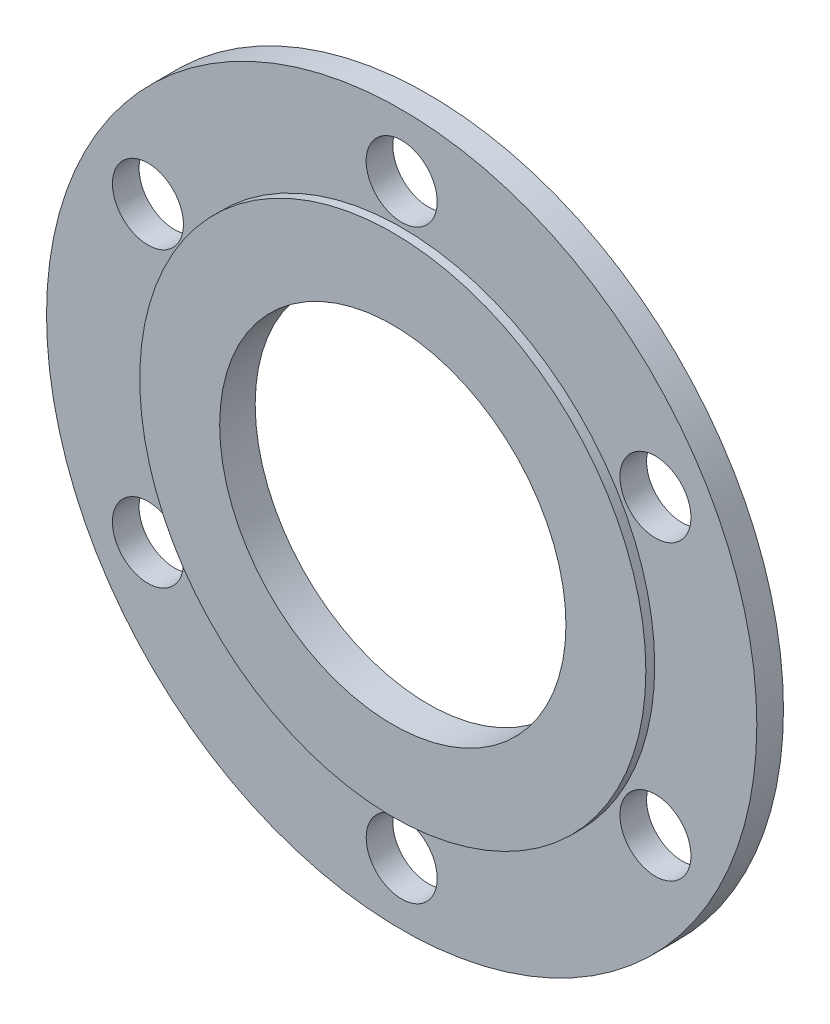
ISO-10303-21;
HEADER;
FILE_DESCRIPTION(('STEP AP214'),'2;1');
FILE_NAME('part.step','',(''),(''),'','','');
FILE_SCHEMA(('AUTOMOTIVE_DESIGN { 1 0 10303 214 1 1 1 1 }'));
ENDSEC;
DATA;
#1=APPLICATION_CONTEXT('core data for automotive mechanical design processes');
#2=APPLICATION_PROTOCOL_DEFINITION('international standard','automotive_design',2000,#1);
#3=PRODUCT_CONTEXT('',#1,'mechanical');
#4=PRODUCT('Part','Part','',(#3));
#5=PRODUCT_RELATED_PRODUCT_CATEGORY('part','',(#4));
#6=PRODUCT_DEFINITION_FORMATION('','',#4);
#7=PRODUCT_DEFINITION_CONTEXT('part definition',#1,'design');
#8=PRODUCT_DEFINITION('design','',#6,#7);
#9=PRODUCT_DEFINITION_SHAPE('','',#8);
#10=(LENGTH_UNIT() NAMED_UNIT(*) SI_UNIT(.MILLI.,.METRE.));
#11=(NAMED_UNIT(*) PLANE_ANGLE_UNIT() SI_UNIT($,.RADIAN.));
#12=(NAMED_UNIT(*) SI_UNIT($,.STERADIAN.) SOLID_ANGLE_UNIT());
#13=UNCERTAINTY_MEASURE_WITH_UNIT(LENGTH_MEASURE(1.E-05),#10,'distance_accuracy_value','');
#14=(GEOMETRIC_REPRESENTATION_CONTEXT(3) GLOBAL_UNCERTAINTY_ASSIGNED_CONTEXT((#13)) GLOBAL_UNIT_ASSIGNED_CONTEXT((#10,
#11,#12)) REPRESENTATION_CONTEXT('',''));
#15=CARTESIAN_POINT('',(0.,0.,0.));
#16=DIRECTION('',(0.,0.,1.));
#17=DIRECTION('',(1.,0.,0.));
#18=AXIS2_PLACEMENT_3D('',#15,#16,#17);
#19=CARTESIAN_POINT('',(0.,0.,3.));
#20=DIRECTION('',(0.,0.,1.));
#21=DIRECTION('',(1.,0.,0.));
#22=AXIS2_PLACEMENT_3D('',#19,#20,#21);
#23=PLANE('',#22);
#24=CARTESIAN_POINT('',(-28.5788383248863,16.5000000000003,3.));
#25=DIRECTION('',(0.,0.,1.));
#26=DIRECTION('',(0.50000000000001,0.866025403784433,0.));
#27=AXIS2_PLACEMENT_3D('',#24,#25,#26);
#28=CIRCLE('',#27,4.);
#29=CARTESIAN_POINT('',(-26.5788383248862,19.9641016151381,3.));
#30=VERTEX_POINT('',#29);
#31=EDGE_CURVE('E88',#30,#30,#28,.T.);
#32=ORIENTED_EDGE('',*,*,#31,.F.);
#33=EDGE_LOOP('',(#32));
#34=FACE_BOUND('',#33,.T.);
#35=CARTESIAN_POINT('',(-28.5788383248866,-16.4999999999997,3.));
#36=DIRECTION('',(0.,0.,1.));
#37=DIRECTION('',(-0.499999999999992,0.866025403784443,0.));
#38=AXIS2_PLACEMENT_3D('',#35,#36,#37);
#39=CIRCLE('',#38,4.);
#40=CARTESIAN_POINT('',(-30.5788383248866,-13.035898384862,3.));
#41=VERTEX_POINT('',#40);
#42=EDGE_CURVE('E82',#41,#41,#39,.T.);
#43=ORIENTED_EDGE('',*,*,#42,.F.);
#44=EDGE_LOOP('',(#43));
#45=FACE_BOUND('',#44,.T.);
#46=CARTESIAN_POINT('',(-2.31888233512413E-13,-33.,3.));
#47=DIRECTION('',(0.,0.,1.));
#48=DIRECTION('',(-1.,0.,0.));
#49=AXIS2_PLACEMENT_3D('',#46,#47,#48);
#50=CIRCLE('',#49,4.);
#51=CARTESIAN_POINT('',(-4.00000000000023,-33.,3.));
#52=VERTEX_POINT('',#51);
#53=EDGE_CURVE('E76',#52,#52,#50,.T.);
#54=ORIENTED_EDGE('',*,*,#53,.F.);
#55=EDGE_LOOP('',(#54));
#56=FACE_BOUND('',#55,.T.);
#57=CARTESIAN_POINT('',(28.5788383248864,-16.5000000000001,3.));
#58=DIRECTION('',(0.,0.,1.));
#59=DIRECTION('',(-0.500000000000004,-0.866025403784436,0.));
#60=AXIS2_PLACEMENT_3D('',#57,#58,#59);
#61=CIRCLE('',#60,4.);
#62=CARTESIAN_POINT('',(26.5788383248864,-19.9641016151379,3.));
#63=VERTEX_POINT('',#62);
#64=EDGE_CURVE('E70',#63,#63,#61,.T.);
#65=ORIENTED_EDGE('',*,*,#64,.F.);
#66=EDGE_LOOP('',(#65));
#67=FACE_BOUND('',#66,.T.);
#68=CARTESIAN_POINT('',(28.5788383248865,16.4999999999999,3.));
#69=DIRECTION('',(0.,0.,1.));
#70=DIRECTION('',(0.499999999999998,-0.86602540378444,0.));
#71=AXIS2_PLACEMENT_3D('',#68,#69,#70);
#72=CIRCLE('',#71,4.);
#73=CARTESIAN_POINT('',(30.5788383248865,13.0358983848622,3.));
#74=VERTEX_POINT('',#73);
#75=EDGE_CURVE('E64',#74,#74,#72,.T.);
#76=ORIENTED_EDGE('',*,*,#75,.F.);
#77=EDGE_LOOP('',(#76));
#78=FACE_BOUND('',#77,.T.);
#79=CARTESIAN_POINT('',(0.,33.,3.));
#80=DIRECTION('',(0.,0.,1.));
#81=DIRECTION('',(1.,0.,0.));
#82=AXIS2_PLACEMENT_3D('',#79,#80,#81);
#83=CIRCLE('',#82,4.);
#84=CARTESIAN_POINT('',(4.,33.,3.));
#85=VERTEX_POINT('',#84);
#86=EDGE_CURVE('E58',#85,#85,#83,.T.);
#87=ORIENTED_EDGE('',*,*,#86,.F.);
#88=EDGE_LOOP('',(#87));
#89=FACE_BOUND('',#88,.T.);
#90=CARTESIAN_POINT('',(0.,0.,3.));
#91=DIRECTION('',(0.,0.,1.));
#92=DIRECTION('',(1.,0.,0.));
#93=AXIS2_PLACEMENT_3D('',#90,#91,#92);
#94=CIRCLE('',#93,40.);
#95=CARTESIAN_POINT('',(40.,0.,3.));
#96=VERTEX_POINT('',#95);
#97=EDGE_CURVE('E10',#96,#96,#94,.T.);
#98=ORIENTED_EDGE('',*,*,#97,.T.);
#99=EDGE_LOOP('',(#98));
#100=FACE_BOUND('',#99,.T.);
#101=CARTESIAN_POINT('',(0.,0.,3.));
#102=DIRECTION('',(0.,0.,1.));
#103=DIRECTION('',(1.,0.,0.));
#104=AXIS2_PLACEMENT_3D('',#101,#102,#103);
#105=CIRCLE('',#104,28.5);
#106=CARTESIAN_POINT('',(28.5,0.,3.));
#107=VERTEX_POINT('',#106);
#108=EDGE_CURVE('E44',#107,#107,#105,.T.);
#109=ORIENTED_EDGE('',*,*,#108,.F.);
#110=EDGE_LOOP('',(#109));
#111=FACE_BOUND('',#110,.T.);
#112=ADVANCED_FACE('F29',(#34,#45,#56,#67,#78,#89,#100,#111),#23,.T.);
#113=CARTESIAN_POINT('',(0.,0.,3.));
#114=DIRECTION('',(0.,0.,-1.));
#115=DIRECTION('',(-1.,0.,0.));
#116=AXIS2_PLACEMENT_3D('',#113,#114,#115);
#117=CYLINDRICAL_SURFACE('',#116,40.);
#118=ORIENTED_EDGE('',*,*,#97,.F.);
#119=EDGE_LOOP('',(#118));
#120=FACE_BOUND('',#119,.T.);
#121=CARTESIAN_POINT('',(0.,0.,0.));
#122=DIRECTION('',(0.,0.,1.));
#123=DIRECTION('',(1.,0.,0.));
#124=AXIS2_PLACEMENT_3D('',#121,#122,#123);
#125=CIRCLE('',#124,40.);
#126=CARTESIAN_POINT('',(40.,0.,0.));
#127=VERTEX_POINT('',#126);
#128=EDGE_CURVE('E36',#127,#127,#125,.T.);
#129=ORIENTED_EDGE('',*,*,#128,.T.);
#130=EDGE_LOOP('',(#129));
#131=FACE_BOUND('',#130,.T.);
#132=ADVANCED_FACE('F31',(#120,#131),#117,.T.);
#133=CARTESIAN_POINT('',(0.,0.,0.));
#134=DIRECTION('',(0.,0.,1.));
#135=DIRECTION('',(1.,0.,0.));
#136=AXIS2_PLACEMENT_3D('',#133,#134,#135);
#137=PLANE('',#136);
#138=CARTESIAN_POINT('',(-28.5788383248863,16.5000000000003,0.));
#139=DIRECTION('',(0.,0.,1.));
#140=DIRECTION('',(0.50000000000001,0.866025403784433,0.));
#141=AXIS2_PLACEMENT_3D('',#138,#139,#140);
#142=CIRCLE('',#141,4.);
#143=CARTESIAN_POINT('',(-26.5788383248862,19.9641016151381,0.));
#144=VERTEX_POINT('',#143);
#145=EDGE_CURVE('E85',#144,#144,#142,.T.);
#146=ORIENTED_EDGE('',*,*,#145,.T.);
#147=EDGE_LOOP('',(#146));
#148=FACE_BOUND('',#147,.T.);
#149=CARTESIAN_POINT('',(-28.5788383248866,-16.4999999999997,0.));
#150=DIRECTION('',(0.,0.,1.));
#151=DIRECTION('',(-0.499999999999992,0.866025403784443,0.));
#152=AXIS2_PLACEMENT_3D('',#149,#150,#151);
#153=CIRCLE('',#152,4.);
#154=CARTESIAN_POINT('',(-30.5788383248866,-13.035898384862,0.));
#155=VERTEX_POINT('',#154);
#156=EDGE_CURVE('E79',#155,#155,#153,.T.);
#157=ORIENTED_EDGE('',*,*,#156,.T.);
#158=EDGE_LOOP('',(#157));
#159=FACE_BOUND('',#158,.T.);
#160=CARTESIAN_POINT('',(-2.31888233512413E-13,-33.,0.));
#161=DIRECTION('',(0.,0.,1.));
#162=DIRECTION('',(-1.,0.,0.));
#163=AXIS2_PLACEMENT_3D('',#160,#161,#162);
#164=CIRCLE('',#163,4.);
#165=CARTESIAN_POINT('',(-4.00000000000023,-33.,0.));
#166=VERTEX_POINT('',#165);
#167=EDGE_CURVE('E73',#166,#166,#164,.T.);
#168=ORIENTED_EDGE('',*,*,#167,.T.);
#169=EDGE_LOOP('',(#168));
#170=FACE_BOUND('',#169,.T.);
#171=CARTESIAN_POINT('',(28.5788383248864,-16.5000000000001,0.));
#172=DIRECTION('',(0.,0.,1.));
#173=DIRECTION('',(-0.500000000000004,-0.866025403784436,0.));
#174=AXIS2_PLACEMENT_3D('',#171,#172,#173);
#175=CIRCLE('',#174,4.);
#176=CARTESIAN_POINT('',(26.5788383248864,-19.9641016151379,0.));
#177=VERTEX_POINT('',#176);
#178=EDGE_CURVE('E67',#177,#177,#175,.T.);
#179=ORIENTED_EDGE('',*,*,#178,.T.);
#180=EDGE_LOOP('',(#179));
#181=FACE_BOUND('',#180,.T.);
#182=CARTESIAN_POINT('',(28.5788383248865,16.4999999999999,0.));
#183=DIRECTION('',(0.,0.,1.));
#184=DIRECTION('',(0.499999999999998,-0.86602540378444,0.));
#185=AXIS2_PLACEMENT_3D('',#182,#183,#184);
#186=CIRCLE('',#185,4.);
#187=CARTESIAN_POINT('',(30.5788383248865,13.0358983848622,0.));
#188=VERTEX_POINT('',#187);
#189=EDGE_CURVE('E61',#188,#188,#186,.T.);
#190=ORIENTED_EDGE('',*,*,#189,.T.);
#191=EDGE_LOOP('',(#190));
#192=FACE_BOUND('',#191,.T.);
#193=CARTESIAN_POINT('',(0.,33.,0.));
#194=DIRECTION('',(0.,0.,1.));
#195=DIRECTION('',(1.,0.,0.));
#196=AXIS2_PLACEMENT_3D('',#193,#194,#195);
#197=CIRCLE('',#196,4.);
#198=CARTESIAN_POINT('',(4.,33.,0.));
#199=VERTEX_POINT('',#198);
#200=EDGE_CURVE('E55',#199,#199,#197,.T.);
#201=ORIENTED_EDGE('',*,*,#200,.T.);
#202=EDGE_LOOP('',(#201));
#203=FACE_BOUND('',#202,.T.);
#204=CARTESIAN_POINT('',(0.,0.,0.));
#205=DIRECTION('',(0.,0.,1.));
#206=DIRECTION('',(1.,0.,0.));
#207=AXIS2_PLACEMENT_3D('',#204,#205,#206);
#208=CIRCLE('',#207,19.5);
#209=CARTESIAN_POINT('',(19.5,0.,0.));
#210=VERTEX_POINT('',#209);
#211=EDGE_CURVE('E49',#210,#210,#208,.T.);
#212=ORIENTED_EDGE('',*,*,#211,.T.);
#213=EDGE_LOOP('',(#212));
#214=FACE_BOUND('',#213,.T.);
#215=ORIENTED_EDGE('',*,*,#128,.F.);
#216=EDGE_LOOP('',(#215));
#217=FACE_BOUND('',#216,.T.);
#218=ADVANCED_FACE('F111',(#148,#159,#170,#181,#192,#203,#214,#217),#137,.F.);
#219=CARTESIAN_POINT('',(0.,0.,4.));
#220=DIRECTION('',(0.,0.,-1.));
#221=DIRECTION('',(-1.,0.,0.));
#222=AXIS2_PLACEMENT_3D('',#219,#220,#221);
#223=CYLINDRICAL_SURFACE('',#222,28.5);
#224=CARTESIAN_POINT('',(0.,0.,4.));
#225=DIRECTION('',(0.,0.,1.));
#226=DIRECTION('',(1.,0.,0.));
#227=AXIS2_PLACEMENT_3D('',#224,#225,#226);
#228=CIRCLE('',#227,28.5);
#229=CARTESIAN_POINT('',(28.5,0.,4.));
#230=VERTEX_POINT('',#229);
#231=EDGE_CURVE('E40',#230,#230,#228,.T.);
#232=ORIENTED_EDGE('',*,*,#231,.F.);
#233=EDGE_LOOP('',(#232));
#234=FACE_BOUND('',#233,.T.);
#235=ORIENTED_EDGE('',*,*,#108,.T.);
#236=EDGE_LOOP('',(#235));
#237=FACE_BOUND('',#236,.T.);
#238=ADVANCED_FACE('F108',(#234,#237),#223,.T.);
#239=CARTESIAN_POINT('',(0.,0.,4.));
#240=DIRECTION('',(0.,0.,1.));
#241=DIRECTION('',(1.,0.,0.));
#242=AXIS2_PLACEMENT_3D('',#239,#240,#241);
#243=PLANE('',#242);
#244=CARTESIAN_POINT('',(0.,0.,4.));
#245=DIRECTION('',(0.,0.,1.));
#246=DIRECTION('',(1.,0.,0.));
#247=AXIS2_PLACEMENT_3D('',#244,#245,#246);
#248=CIRCLE('',#247,19.5);
#249=CARTESIAN_POINT('',(19.5,0.,4.));
#250=VERTEX_POINT('',#249);
#251=EDGE_CURVE('E52',#250,#250,#248,.T.);
#252=ORIENTED_EDGE('',*,*,#251,.F.);
#253=EDGE_LOOP('',(#252));
#254=FACE_BOUND('',#253,.T.);
#255=ORIENTED_EDGE('',*,*,#231,.T.);
#256=EDGE_LOOP('',(#255));
#257=FACE_BOUND('',#256,.T.);
#258=ADVANCED_FACE('F110',(#254,#257),#243,.T.);
#259=CARTESIAN_POINT('',(0.,0.,0.));
#260=DIRECTION('',(0.,0.,1.));
#261=DIRECTION('',(1.,0.,0.));
#262=AXIS2_PLACEMENT_3D('',#259,#260,#261);
#263=CYLINDRICAL_SURFACE('',#262,19.5);
#264=ORIENTED_EDGE('',*,*,#211,.F.);
#265=EDGE_LOOP('',(#264));
#266=FACE_BOUND('',#265,.T.);
#267=ORIENTED_EDGE('',*,*,#251,.T.);
#268=EDGE_LOOP('',(#267));
#269=FACE_BOUND('',#268,.T.);
#270=ADVANCED_FACE('F118',(#266,#269),#263,.F.);
#271=CARTESIAN_POINT('',(0.,33.,0.));
#272=DIRECTION('',(0.,0.,1.));
#273=DIRECTION('',(1.,0.,0.));
#274=AXIS2_PLACEMENT_3D('',#271,#272,#273);
#275=CYLINDRICAL_SURFACE('',#274,4.);
#276=ORIENTED_EDGE('',*,*,#200,.F.);
#277=EDGE_LOOP('',(#276));
#278=FACE_BOUND('',#277,.T.);
#279=ORIENTED_EDGE('',*,*,#86,.T.);
#280=EDGE_LOOP('',(#279));
#281=FACE_BOUND('',#280,.T.);
#282=ADVANCED_FACE('F128',(#278,#281),#275,.F.);
#283=CARTESIAN_POINT('',(28.5788383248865,16.4999999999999,0.));
#284=DIRECTION('',(0.,0.,1.));
#285=DIRECTION('',(1.,0.,0.));
#286=AXIS2_PLACEMENT_3D('',#283,#284,#285);
#287=CYLINDRICAL_SURFACE('',#286,4.);
#288=ORIENTED_EDGE('',*,*,#189,.F.);
#289=EDGE_LOOP('',(#288));
#290=FACE_BOUND('',#289,.T.);
#291=ORIENTED_EDGE('',*,*,#75,.T.);
#292=EDGE_LOOP('',(#291));
#293=FACE_BOUND('',#292,.T.);
#294=ADVANCED_FACE('F132',(#290,#293),#287,.F.);
#295=CARTESIAN_POINT('',(28.5788383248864,-16.5000000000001,0.));
#296=DIRECTION('',(0.,0.,1.));
#297=DIRECTION('',(1.,0.,0.));
#298=AXIS2_PLACEMENT_3D('',#295,#296,#297);
#299=CYLINDRICAL_SURFACE('',#298,4.);
#300=ORIENTED_EDGE('',*,*,#178,.F.);
#301=EDGE_LOOP('',(#300));
#302=FACE_BOUND('',#301,.T.);
#303=ORIENTED_EDGE('',*,*,#64,.T.);
#304=EDGE_LOOP('',(#303));
#305=FACE_BOUND('',#304,.T.);
#306=ADVANCED_FACE('F136',(#302,#305),#299,.F.);
#307=CARTESIAN_POINT('',(-2.31888233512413E-13,-33.,0.));
#308=DIRECTION('',(0.,0.,1.));
#309=DIRECTION('',(1.,0.,0.));
#310=AXIS2_PLACEMENT_3D('',#307,#308,#309);
#311=CYLINDRICAL_SURFACE('',#310,4.);
#312=ORIENTED_EDGE('',*,*,#167,.F.);
#313=EDGE_LOOP('',(#312));
#314=FACE_BOUND('',#313,.T.);
#315=ORIENTED_EDGE('',*,*,#53,.T.);
#316=EDGE_LOOP('',(#315));
#317=FACE_BOUND('',#316,.T.);
#318=ADVANCED_FACE('F140',(#314,#317),#311,.F.);
#319=CARTESIAN_POINT('',(-28.5788383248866,-16.4999999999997,0.));
#320=DIRECTION('',(0.,0.,1.));
#321=DIRECTION('',(1.,0.,0.));
#322=AXIS2_PLACEMENT_3D('',#319,#320,#321);
#323=CYLINDRICAL_SURFACE('',#322,4.);
#324=ORIENTED_EDGE('',*,*,#156,.F.);
#325=EDGE_LOOP('',(#324));
#326=FACE_BOUND('',#325,.T.);
#327=ORIENTED_EDGE('',*,*,#42,.T.);
#328=EDGE_LOOP('',(#327));
#329=FACE_BOUND('',#328,.T.);
#330=ADVANCED_FACE('F144',(#326,#329),#323,.F.);
#331=CARTESIAN_POINT('',(-28.5788383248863,16.5000000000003,0.));
#332=DIRECTION('',(0.,0.,1.));
#333=DIRECTION('',(1.,0.,0.));
#334=AXIS2_PLACEMENT_3D('',#331,#332,#333);
#335=CYLINDRICAL_SURFACE('',#334,4.);
#336=ORIENTED_EDGE('',*,*,#145,.F.);
#337=EDGE_LOOP('',(#336));
#338=FACE_BOUND('',#337,.T.);
#339=ORIENTED_EDGE('',*,*,#31,.T.);
#340=EDGE_LOOP('',(#339));
#341=FACE_BOUND('',#340,.T.);
#342=ADVANCED_FACE('F92',(#338,#341),#335,.F.);
#343=CLOSED_SHELL('',(#112,#132,#218,#238,#258,#270,#282,#294,#306,#318,#330,#342));
#344=MANIFOLD_SOLID_BREP('B2',#343);
#345=ADVANCED_BREP_SHAPE_REPRESENTATION('',(#18,#344),#14);
#346=SHAPE_DEFINITION_REPRESENTATION(#9,#345);
ENDSEC;
END-ISO-10303-21;
